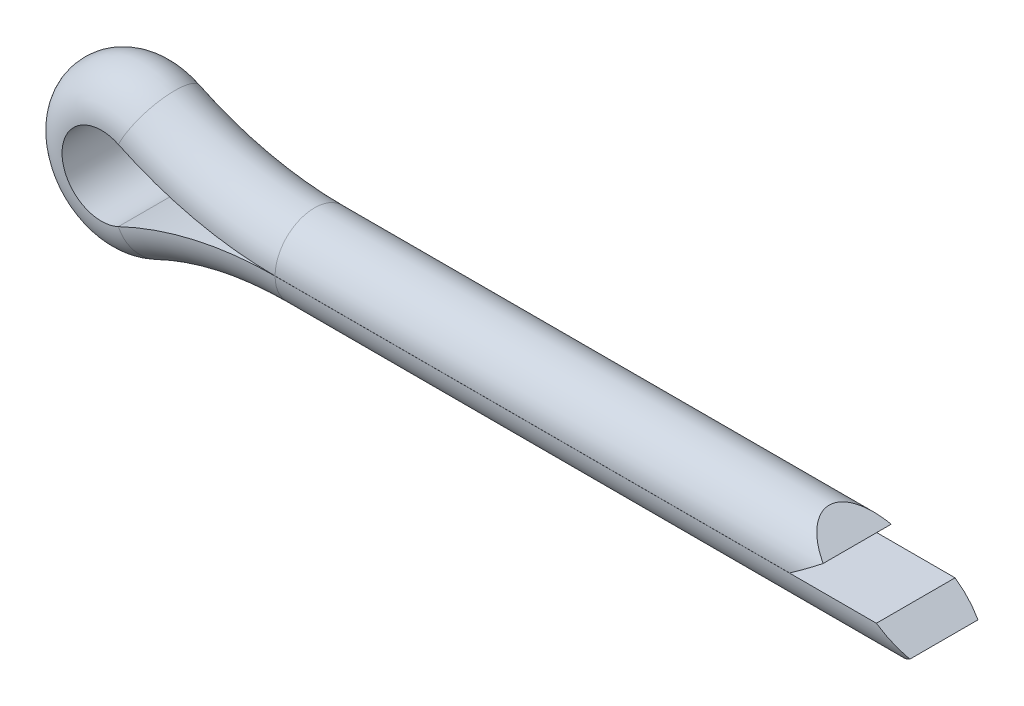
from build123d import *

# Parameters (mm, degrees)
CONECUT_DEPTH      = 30.777046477
CONECUT_DEPTH_BACK = 30.777046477


with BuildPart() as part:
    # BaseBody: sweep along a path in PathSke
    with BuildLine(Plane.XY) as basebody_path:
        Line((26.4, 1.45), (6.4, 1.45))
        ThreePointArc((6.4, 1.45), (3.759689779, 1.745354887), (1.249904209, 2.616818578))
        ThreePointArc((1.249904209, 2.616818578), (-2.9, 0), (1.249904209, -2.616818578))
        ThreePointArc((1.249904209, -2.616818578), (3.759689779, -1.745354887), (6.4, -1.45))
        Line((6.4, -1.45), (29.6, -1.45))
    # SectionSke → BaseBody (sweep)
    with BuildSketch(Plane(origin=(26.4, 1.45, 0), x_dir=(0, 0, -1), z_dir=(1, 0, 0))):
        with BuildLine():
            Line((-1.449998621, -1.448), (1.449998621, -1.448))
            ThreePointArc((1.449998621, -1.448), (0, 0), (-1.449998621, -1.448))
        make_face()
    sweep(path=basebody_path.line)

    # ConeCutSke → ConeCut (cut, two sides: drawn at the far end of the back side and taken through both)
    with BuildSketch(Plane.XY.offset(-CONECUT_DEPTH_BACK)):
        Polygon((25.357462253, 1.46), (29.61, 1.46), (29.61, -1.46), (28.557462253, -1.46), (29.6, -0.726), (28.557462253, 0), (25.357462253, 0), (26.4, 0.726), align=None)
    extrude(amount=CONECUT_DEPTH + CONECUT_DEPTH_BACK, mode=Mode.SUBTRACT)


solid = part.part
